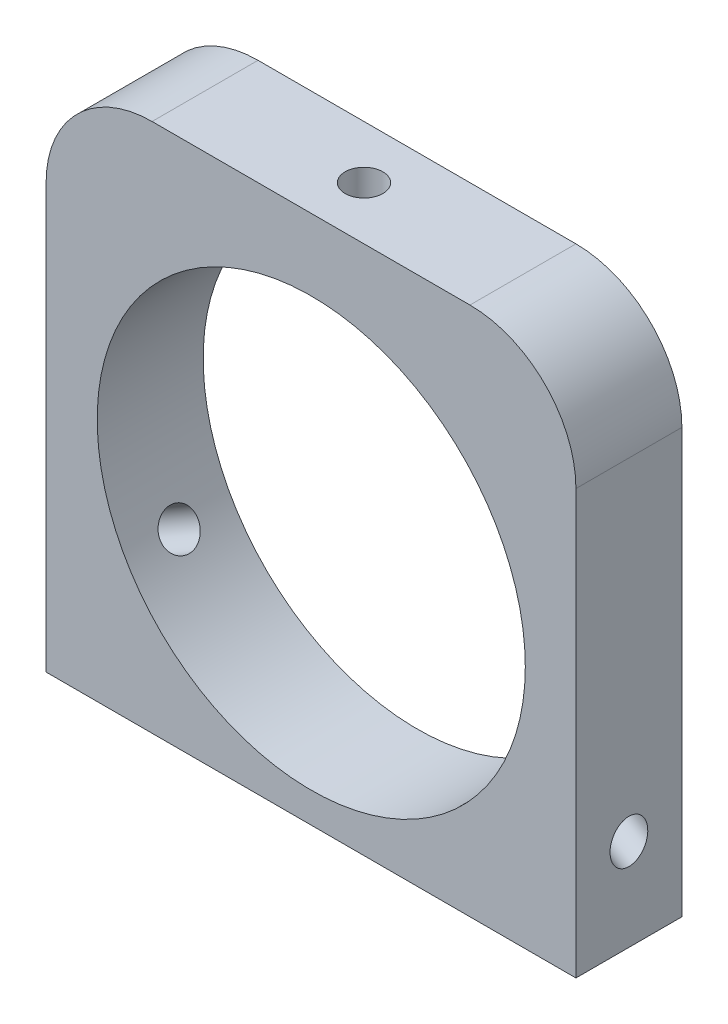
from build123d import *

# Parameters (mm, degrees)
SKETCH1_W                 = 31.75
SKETCH1_H                 = 6.35
BOSS_EXTRUDE1_DEPTH       = 31.75
F_4_40_TAPPED_HOLE1_D     = 2.2606
F_4_40_TAPPED_HOLE1_DEPTH = 4.826
F_4_40_TAPPED_HOLE1_TIP   = 0.679152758
SKETCH4_R                 = 12.827
CUT_EXTRUDE1_DEPTH        = 8.128
FILLET1_R                 = 6.35
CIRPATTERN2_COUNT         = 3


with BuildPart() as part:
    # Sketch1 → Boss-Extrude1 (new body)
    with BuildSketch(Plane(origin=(0, 0, 0), x_dir=(1, 0, 0), z_dir=(0, 1, 0))):
        Rectangle(SKETCH1_W, SKETCH1_H)
    extrude(amount=BOSS_EXTRUDE1_DEPTH)

    # 4-40 Tapped Hole1
    with Locations(Plane(origin=(0, 0, 0), x_dir=(-1, 0, 0), z_dir=(0, -1, 0))):
        with Locations((12.7, 0), (-12.7, 0)):
            Hole(F_4_40_TAPPED_HOLE1_D / 2, depth=F_4_40_TAPPED_HOLE1_DEPTH)
            with Locations((0, 0, -(F_4_40_TAPPED_HOLE1_DEPTH + F_4_40_TAPPED_HOLE1_TIP / 2))):  # 118° drill point
                Cone(0, F_4_40_TAPPED_HOLE1_D / 2, F_4_40_TAPPED_HOLE1_TIP, mode=Mode.SUBTRACT)

    # Sketch4 → Cut-Extrude1 (cut)
    with BuildSketch(Plane.XY.offset(3.175)):
        with Locations((0.014488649, 14.639526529)):
            Circle(SKETCH4_R)
    extrude(amount=-CUT_EXTRUDE1_DEPTH, mode=Mode.SUBTRACT)

    # Fillet1
    fillet1_edges = [part.edges().sort_by_distance(p)[0] for p in [
        (-15.875, 31.75, 0),
        (15.875, 31.75, 0),
    ]]
    fillet(fillet1_edges, radius=FILLET1_R)

    # Sketch8 → 4-40 Tapped Hole3 (revolve, cut)
    with BuildSketch(Plane(origin=(0, 34.29, 0), x_dir=(0, 0, 1), z_dir=(1, 0, 0))):
        Polygon((0, 0), (0, 13.379152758), (1.1303, 12.7), (1.1303, 0), align=None)
    f_4_40_tapped_hole3 = revolve(axis=Axis((0, 40.64, 0), (0, -1, 0)), mode=Mode.SUBTRACT)

    # CirPattern2: 4-40 Tapped Hole3 ×3 about axis
    cirpattern2_axis = Axis((0.014488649, 14.639526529, 3.175), (0, 0, 1))
    for i in range(1, CIRPATTERN2_COUNT):
        add(f_4_40_tapped_hole3.rotate(cirpattern2_axis, i * 360 / CIRPATTERN2_COUNT), mode=Mode.SUBTRACT)


solid = part.part
